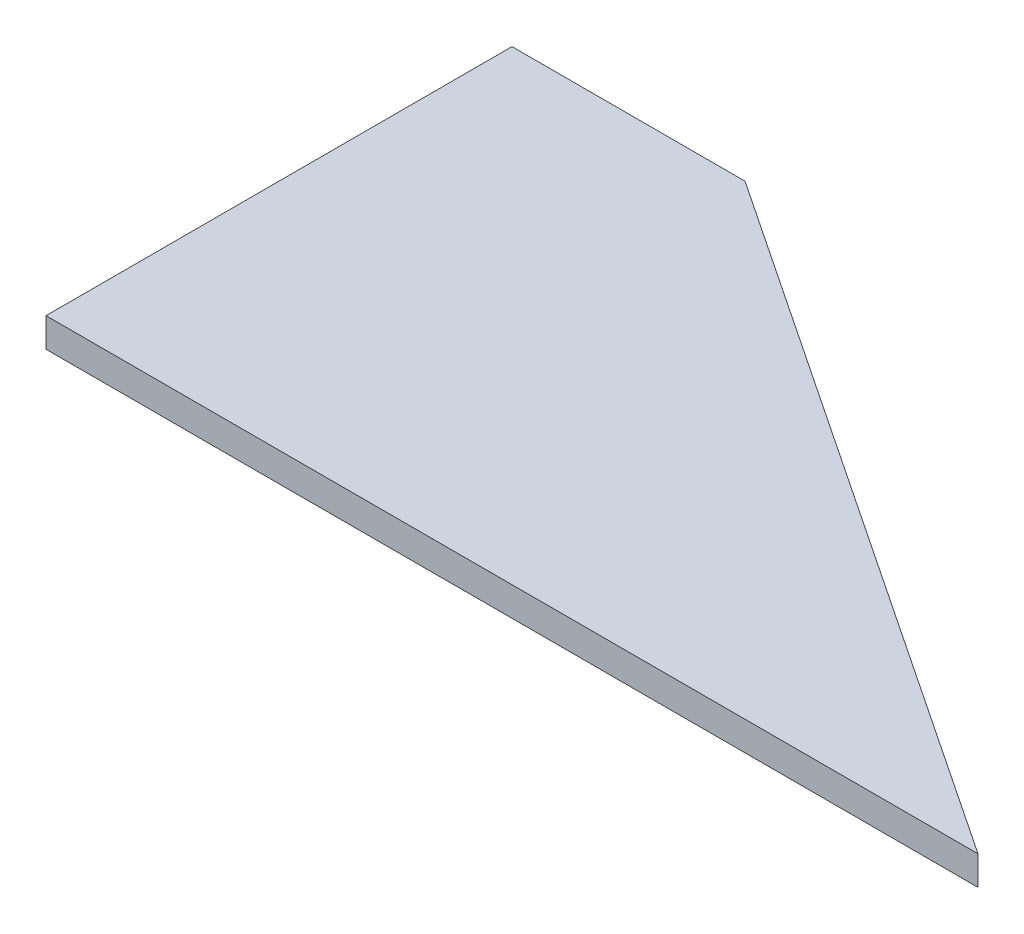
ISO-10303-21;
HEADER;
FILE_DESCRIPTION(('STEP AP214'),'2;1');
FILE_NAME('part.step','',(''),(''),'','','');
FILE_SCHEMA(('AUTOMOTIVE_DESIGN { 1 0 10303 214 1 1 1 1 }'));
ENDSEC;
DATA;
#1=APPLICATION_CONTEXT('core data for automotive mechanical design processes');
#2=APPLICATION_PROTOCOL_DEFINITION('international standard','automotive_design',2000,#1);
#3=PRODUCT_CONTEXT('',#1,'mechanical');
#4=PRODUCT('Part','Part','',(#3));
#5=PRODUCT_RELATED_PRODUCT_CATEGORY('part','',(#4));
#6=PRODUCT_DEFINITION_FORMATION('','',#4);
#7=PRODUCT_DEFINITION_CONTEXT('part definition',#1,'design');
#8=PRODUCT_DEFINITION('design','',#6,#7);
#9=PRODUCT_DEFINITION_SHAPE('','',#8);
#10=(LENGTH_UNIT() NAMED_UNIT(*) SI_UNIT(.MILLI.,.METRE.));
#11=(NAMED_UNIT(*) PLANE_ANGLE_UNIT() SI_UNIT($,.RADIAN.));
#12=(NAMED_UNIT(*) SI_UNIT($,.STERADIAN.) SOLID_ANGLE_UNIT());
#13=UNCERTAINTY_MEASURE_WITH_UNIT(LENGTH_MEASURE(1.E-05),#10,'distance_accuracy_value','');
#14=(GEOMETRIC_REPRESENTATION_CONTEXT(3) GLOBAL_UNCERTAINTY_ASSIGNED_CONTEXT((#13)) GLOBAL_UNIT_ASSIGNED_CONTEXT((#10,
#11,#12)) REPRESENTATION_CONTEXT('',''));
#15=CARTESIAN_POINT('',(0.,0.,0.));
#16=DIRECTION('',(0.,0.,1.));
#17=DIRECTION('',(1.,0.,0.));
#18=AXIS2_PLACEMENT_3D('',#15,#16,#17);
#19=CARTESIAN_POINT('',(0.,9.52500000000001,0.));
#20=DIRECTION('',(0.,0.,-1.00000000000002));
#21=DIRECTION('',(-1.00000000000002,0.,0.));
#22=AXIS2_PLACEMENT_3D('',#19,#20,#21);
#23=PLANE('',#22);
#24=DIRECTION('',(1.00000000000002,0.,0.));
#25=VECTOR('',#24,1.);
#26=CARTESIAN_POINT('',(0.,0.,0.));
#27=LINE('',#26,#25);
#28=CARTESIAN_POINT('',(0.,0.,0.));
#29=VERTEX_POINT('',#28);
#30=CARTESIAN_POINT('',(304.8,0.,-9.99200722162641E-13));
#31=VERTEX_POINT('',#30);
#32=EDGE_CURVE('E95',#29,#31,#27,.T.);
#33=ORIENTED_EDGE('',*,*,#32,.T.);
#34=DIRECTION('',(0.,-1.,0.));
#35=VECTOR('',#34,1.);
#36=CARTESIAN_POINT('',(304.8,9.52500000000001,-9.99200722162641E-13));
#37=LINE('',#36,#35);
#38=CARTESIAN_POINT('',(304.8,9.52500000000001,-9.99200722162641E-13));
#39=VERTEX_POINT('',#38);
#40=EDGE_CURVE('E11',#39,#31,#37,.T.);
#41=ORIENTED_EDGE('',*,*,#40,.F.);
#42=DIRECTION('',(1.00000000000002,0.,0.));
#43=VECTOR('',#42,1.);
#44=CARTESIAN_POINT('',(0.,9.52500000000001,0.));
#45=LINE('',#44,#43);
#46=CARTESIAN_POINT('',(0.,9.52500000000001,0.));
#47=VERTEX_POINT('',#46);
#48=EDGE_CURVE('E83',#47,#39,#45,.T.);
#49=ORIENTED_EDGE('',*,*,#48,.F.);
#50=DIRECTION('',(0.,-1.,0.));
#51=VECTOR('',#50,1.);
#52=CARTESIAN_POINT('',(0.,9.52500000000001,0.));
#53=LINE('',#52,#51);
#54=EDGE_CURVE('E91',#47,#29,#53,.T.);
#55=ORIENTED_EDGE('',*,*,#54,.T.);
#56=EDGE_LOOP('',(#33,#41,#49,#55));
#57=FACE_BOUND('',#56,.T.);
#58=ADVANCED_FACE('F32',(#57),#23,.F.);
#59=CARTESIAN_POINT('',(304.8,9.52500000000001,-9.99200722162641E-13));
#60=DIRECTION('',(-0.554700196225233,0.,0.83205029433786));
#61=DIRECTION('',(0.83205029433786,0.,0.554700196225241));
#62=AXIS2_PLACEMENT_3D('',#59,#60,#61);
#63=PLANE('',#62);
#64=DIRECTION('',(-0.83205029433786,0.,-0.554700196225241));
#65=VECTOR('',#64,1.);
#66=CARTESIAN_POINT('',(304.8,0.,-9.99200722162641E-13));
#67=LINE('',#66,#65);
#68=CARTESIAN_POINT('',(76.2,0.,-152.400000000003));
#69=VERTEX_POINT('',#68);
#70=EDGE_CURVE('E87',#31,#69,#67,.T.);
#71=ORIENTED_EDGE('',*,*,#70,.T.);
#72=DIRECTION('',(0.,-1.,0.));
#73=VECTOR('',#72,1.);
#74=CARTESIAN_POINT('',(76.2,9.52500000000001,-152.400000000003));
#75=LINE('',#74,#73);
#76=CARTESIAN_POINT('',(76.2,9.52500000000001,-152.400000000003));
#77=VERTEX_POINT('',#76);
#78=EDGE_CURVE('E40',#77,#69,#75,.T.);
#79=ORIENTED_EDGE('',*,*,#78,.F.);
#80=DIRECTION('',(-0.83205029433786,0.,-0.554700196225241));
#81=VECTOR('',#80,1.);
#82=CARTESIAN_POINT('',(304.8,9.52500000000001,-9.99200722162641E-13));
#83=LINE('',#82,#81);
#84=EDGE_CURVE('E78',#39,#77,#83,.T.);
#85=ORIENTED_EDGE('',*,*,#84,.F.);
#86=ORIENTED_EDGE('',*,*,#40,.T.);
#87=EDGE_LOOP('',(#71,#79,#85,#86));
#88=FACE_BOUND('',#87,.T.);
#89=ADVANCED_FACE('F86',(#88),#63,.F.);
#90=CARTESIAN_POINT('',(76.2,9.52500000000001,-152.400000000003));
#91=DIRECTION('',(0.,0.,1.00000000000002));
#92=DIRECTION('',(1.00000000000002,0.,0.));
#93=AXIS2_PLACEMENT_3D('',#90,#91,#92);
#94=PLANE('',#93);
#95=DIRECTION('',(-1.00000000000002,0.,0.));
#96=VECTOR('',#95,1.);
#97=CARTESIAN_POINT('',(76.2,0.,-152.400000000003));
#98=LINE('',#97,#96);
#99=CARTESIAN_POINT('',(0.,0.,-152.400000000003));
#100=VERTEX_POINT('',#99);
#101=EDGE_CURVE('E65',#69,#100,#98,.T.);
#102=ORIENTED_EDGE('',*,*,#101,.T.);
#103=DIRECTION('',(0.,-1.,0.));
#104=VECTOR('',#103,1.);
#105=CARTESIAN_POINT('',(0.,9.52500000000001,-152.400000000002));
#106=LINE('',#105,#104);
#107=CARTESIAN_POINT('',(0.,9.52500000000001,-152.400000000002));
#108=VERTEX_POINT('',#107);
#109=EDGE_CURVE('E88',#108,#100,#106,.T.);
#110=ORIENTED_EDGE('',*,*,#109,.F.);
#111=DIRECTION('',(-1.00000000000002,0.,0.));
#112=VECTOR('',#111,1.);
#113=CARTESIAN_POINT('',(76.2,9.52500000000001,-152.400000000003));
#114=LINE('',#113,#112);
#115=EDGE_CURVE('E81',#77,#108,#114,.T.);
#116=ORIENTED_EDGE('',*,*,#115,.F.);
#117=ORIENTED_EDGE('',*,*,#78,.T.);
#118=EDGE_LOOP('',(#102,#110,#116,#117));
#119=FACE_BOUND('',#118,.T.);
#120=ADVANCED_FACE('F89',(#119),#94,.F.);
#121=CARTESIAN_POINT('',(0.,9.52500000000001,0.));
#122=DIRECTION('',(1.00000000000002,0.,0.));
#123=DIRECTION('',(0.,0.,-1.00000000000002));
#124=AXIS2_PLACEMENT_3D('',#121,#122,#123);
#125=PLANE('',#124);
#126=DIRECTION('',(0.,0.,1.00000000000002));
#127=VECTOR('',#126,1.);
#128=CARTESIAN_POINT('',(0.,0.,0.));
#129=LINE('',#128,#127);
#130=EDGE_CURVE('E71',#100,#29,#129,.T.);
#131=ORIENTED_EDGE('',*,*,#130,.T.);
#132=ORIENTED_EDGE('',*,*,#54,.F.);
#133=DIRECTION('',(0.,0.,1.00000000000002));
#134=VECTOR('',#133,1.);
#135=CARTESIAN_POINT('',(0.,9.52500000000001,0.));
#136=LINE('',#135,#134);
#137=EDGE_CURVE('E48',#108,#47,#136,.T.);
#138=ORIENTED_EDGE('',*,*,#137,.F.);
#139=ORIENTED_EDGE('',*,*,#109,.T.);
#140=EDGE_LOOP('',(#131,#132,#138,#139));
#141=FACE_BOUND('',#140,.T.);
#142=ADVANCED_FACE('F102',(#141),#125,.F.);
#143=CARTESIAN_POINT('',(0.,9.52500000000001,0.));
#144=DIRECTION('',(0.,1.,0.));
#145=DIRECTION('',(0.,0.,1.00000000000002));
#146=AXIS2_PLACEMENT_3D('',#143,#144,#145);
#147=PLANE('',#146);
#148=ORIENTED_EDGE('',*,*,#48,.T.);
#149=ORIENTED_EDGE('',*,*,#84,.T.);
#150=ORIENTED_EDGE('',*,*,#115,.T.);
#151=ORIENTED_EDGE('',*,*,#137,.T.);
#152=EDGE_LOOP('',(#148,#149,#150,#151));
#153=FACE_BOUND('',#152,.T.);
#154=ADVANCED_FACE('F79',(#153),#147,.T.);
#155=CARTESIAN_POINT('',(0.,0.,0.));
#156=DIRECTION('',(0.,1.,0.));
#157=DIRECTION('',(0.,0.,1.00000000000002));
#158=AXIS2_PLACEMENT_3D('',#155,#156,#157);
#159=PLANE('',#158);
#160=ORIENTED_EDGE('',*,*,#32,.F.);
#161=ORIENTED_EDGE('',*,*,#130,.F.);
#162=ORIENTED_EDGE('',*,*,#101,.F.);
#163=ORIENTED_EDGE('',*,*,#70,.F.);
#164=EDGE_LOOP('',(#160,#161,#162,#163));
#165=FACE_BOUND('',#164,.T.);
#166=ADVANCED_FACE('F105',(#165),#159,.F.);
#167=CLOSED_SHELL('',(#58,#89,#120,#142,#154,#166));
#168=MANIFOLD_SOLID_BREP('B2',#167);
#169=ADVANCED_BREP_SHAPE_REPRESENTATION('',(#18,#168),#14);
#170=SHAPE_DEFINITION_REPRESENTATION(#9,#169);
ENDSEC;
END-ISO-10303-21;
